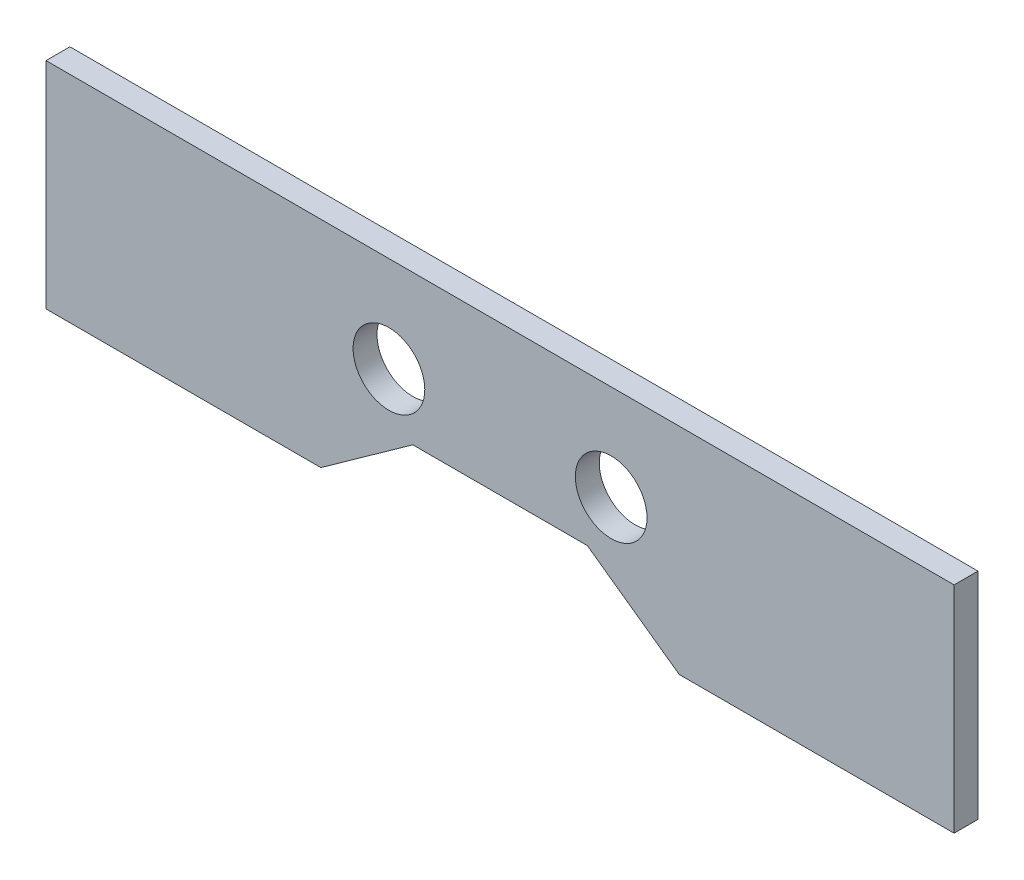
from build123d import *

# Parameters (mm, degrees)
SKETCH1_W          = 965.2
SKETCH1_H          = 228.6
SKETCH1_R          = 38.1
EXTRUDE1_DEPTH     = 25.4
CUT_EXTRUDE1_DEPTH = 499.217850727


with BuildPart() as part:
    # Sketch1 → Extrude1 (new body)
    with BuildSketch(Plane.XY):
        with Locations((0, -6.8326)):
            Rectangle(SKETCH1_W, SKETCH1_H)
        with Locations((118.11, 5.8674)):
            Circle(SKETCH1_R, mode=Mode.SUBTRACT)
        with Locations((-118.11, 5.8674)):
            Circle(SKETCH1_R, mode=Mode.SUBTRACT)
    extrude(amount=EXTRUDE1_DEPTH)

    # Sketch2 → Cut-Extrude1 (cut, through all)
    with BuildSketch(Plane.XY.offset(25.4)):
        Polygon((-190.5, -121.1326), (-92.71, -51.2826), (92.71, -51.2826), (190.5, -121.1326), align=None)
    extrude(amount=-CUT_EXTRUDE1_DEPTH, mode=Mode.SUBTRACT)


solid = part.part
